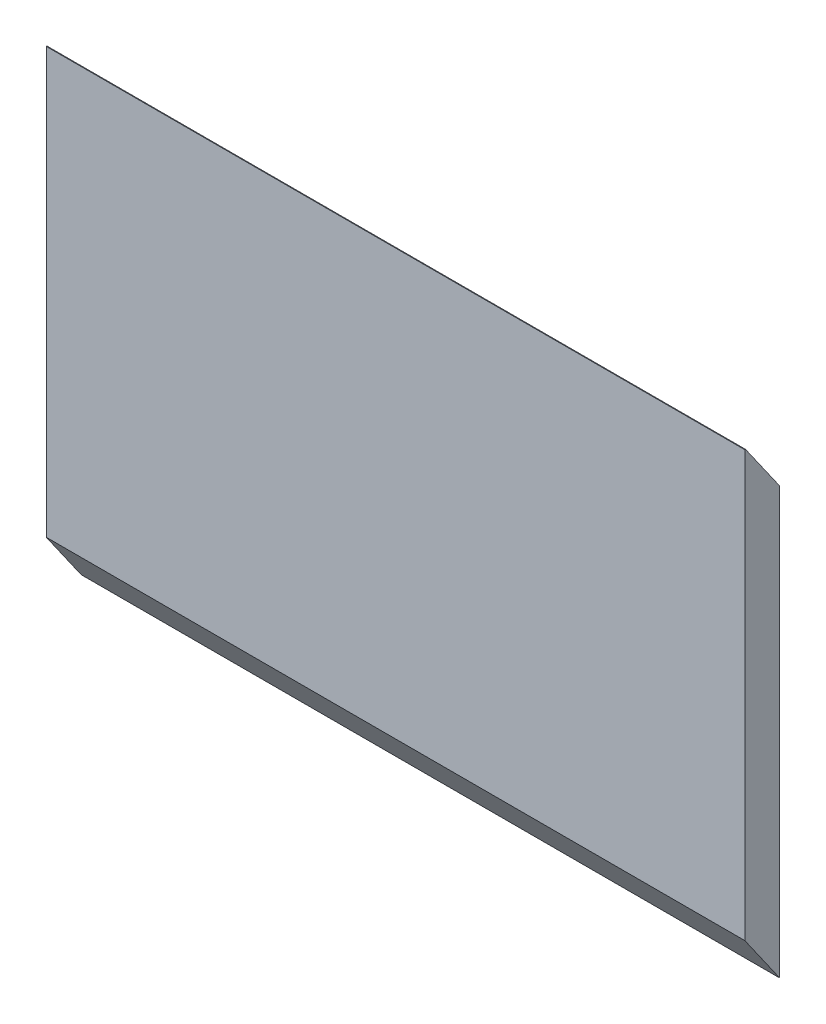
ISO-10303-21;
HEADER;
FILE_DESCRIPTION(('STEP AP214'),'2;1');
FILE_NAME('part.step','',(''),(''),'','','');
FILE_SCHEMA(('AUTOMOTIVE_DESIGN { 1 0 10303 214 1 1 1 1 }'));
ENDSEC;
DATA;
#1=APPLICATION_CONTEXT('core data for automotive mechanical design processes');
#2=APPLICATION_PROTOCOL_DEFINITION('international standard','automotive_design',2000,#1);
#3=PRODUCT_CONTEXT('',#1,'mechanical');
#4=PRODUCT('Part','Part','',(#3));
#5=PRODUCT_RELATED_PRODUCT_CATEGORY('part','',(#4));
#6=PRODUCT_DEFINITION_FORMATION('','',#4);
#7=PRODUCT_DEFINITION_CONTEXT('part definition',#1,'design');
#8=PRODUCT_DEFINITION('design','',#6,#7);
#9=PRODUCT_DEFINITION_SHAPE('','',#8);
#10=(LENGTH_UNIT() NAMED_UNIT(*) SI_UNIT(.MILLI.,.METRE.));
#11=(NAMED_UNIT(*) PLANE_ANGLE_UNIT() SI_UNIT($,.RADIAN.));
#12=(NAMED_UNIT(*) SI_UNIT($,.STERADIAN.) SOLID_ANGLE_UNIT());
#13=UNCERTAINTY_MEASURE_WITH_UNIT(LENGTH_MEASURE(1.E-05),#10,'distance_accuracy_value','');
#14=(GEOMETRIC_REPRESENTATION_CONTEXT(3) GLOBAL_UNCERTAINTY_ASSIGNED_CONTEXT((#13)) GLOBAL_UNIT_ASSIGNED_CONTEXT((#10,
#11,#12)) REPRESENTATION_CONTEXT('',''));
#15=CARTESIAN_POINT('',(0.,0.,0.));
#16=DIRECTION('',(0.,0.,1.));
#17=DIRECTION('',(1.,0.,0.));
#18=AXIS2_PLACEMENT_3D('',#15,#16,#17);
#19=CARTESIAN_POINT('',(-63.5,43.18,3.175));
#20=DIRECTION('',(1.,0.,0.));
#21=DIRECTION('',(0.,0.,-1.));
#22=AXIS2_PLACEMENT_3D('',#19,#20,#21);
#23=PLANE('',#22);
#24=DIRECTION('',(0.,-1.,0.));
#25=VECTOR('',#24,1.);
#26=CARTESIAN_POINT('',(-63.5,43.18,-3.175));
#27=LINE('',#26,#25);
#28=CARTESIAN_POINT('',(-63.5,34.2899999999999,-3.175));
#29=VERTEX_POINT('',#28);
#30=CARTESIAN_POINT('',(-63.5,-43.18,-3.175));
#31=VERTEX_POINT('',#30);
#32=EDGE_CURVE('E111',#29,#31,#27,.T.);
#33=ORIENTED_EDGE('',*,*,#32,.T.);
#34=DIRECTION('',(0.,0.819152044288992,0.573576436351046));
#35=VECTOR('',#34,1.);
#36=CARTESIAN_POINT('',(-63.5,-34.1112601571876,3.175));
#37=LINE('',#36,#35);
#38=CARTESIAN_POINT('',(-63.5,-34.1112601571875,3.17500000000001));
#39=VERTEX_POINT('',#38);
#40=EDGE_CURVE('E11',#31,#39,#37,.T.);
#41=ORIENTED_EDGE('',*,*,#40,.T.);
#42=DIRECTION('',(0.,-1.,0.));
#43=VECTOR('',#42,1.);
#44=CARTESIAN_POINT('',(-63.5,43.18,3.175));
#45=LINE('',#44,#43);
#46=CARTESIAN_POINT('',(-63.5,43.18,3.175));
#47=VERTEX_POINT('',#46);
#48=EDGE_CURVE('E91',#47,#39,#45,.T.);
#49=ORIENTED_EDGE('',*,*,#48,.F.);
#50=DIRECTION('',(0.,0.,-1.));
#51=VECTOR('',#50,1.);
#52=CARTESIAN_POINT('',(-63.5,43.18,3.175));
#53=LINE('',#52,#51);
#54=CARTESIAN_POINT('',(-63.5,43.18,3.04984501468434));
#55=VERTEX_POINT('',#54);
#56=EDGE_CURVE('E103',#47,#55,#53,.T.);
#57=ORIENTED_EDGE('',*,*,#56,.T.);
#58=DIRECTION('',(0.,0.819152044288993,0.573576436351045));
#59=VECTOR('',#58,1.);
#60=CARTESIAN_POINT('',(-63.5,43.18,3.04984501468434));
#61=LINE('',#60,#59);
#62=EDGE_CURVE('E119',#55,#29,#61,.F.);
#63=ORIENTED_EDGE('',*,*,#62,.T.);
#64=EDGE_LOOP('',(#33,#41,#49,#57,#63));
#65=FACE_BOUND('',#64,.T.);
#66=ADVANCED_FACE('F37',(#65),#23,.F.);
#67=CARTESIAN_POINT('',(63.5,43.18,3.175));
#68=DIRECTION('',(-1.,0.,0.));
#69=DIRECTION('',(0.,0.,1.));
#70=AXIS2_PLACEMENT_3D('',#67,#68,#69);
#71=PLANE('',#70);
#72=DIRECTION('',(0.,1.,0.));
#73=VECTOR('',#72,1.);
#74=CARTESIAN_POINT('',(63.5,43.18,3.175));
#75=LINE('',#74,#73);
#76=CARTESIAN_POINT('',(63.5,-34.1112601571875,3.17500000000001));
#77=VERTEX_POINT('',#76);
#78=CARTESIAN_POINT('',(63.5,43.18,3.175));
#79=VERTEX_POINT('',#78);
#80=EDGE_CURVE('E82',#77,#79,#75,.T.);
#81=ORIENTED_EDGE('',*,*,#80,.F.);
#82=DIRECTION('',(0.,-0.819152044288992,-0.573576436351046));
#83=VECTOR('',#82,1.);
#84=CARTESIAN_POINT('',(63.5,-34.1112601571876,3.175));
#85=LINE('',#84,#83);
#86=CARTESIAN_POINT('',(63.5,-43.18,-3.175));
#87=VERTEX_POINT('',#86);
#88=EDGE_CURVE('E45',#77,#87,#85,.T.);
#89=ORIENTED_EDGE('',*,*,#88,.T.);
#90=DIRECTION('',(0.,1.,0.));
#91=VECTOR('',#90,1.);
#92=CARTESIAN_POINT('',(63.5,43.18,-3.175));
#93=LINE('',#92,#91);
#94=CARTESIAN_POINT('',(63.5,34.2899999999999,-3.175));
#95=VERTEX_POINT('',#94);
#96=EDGE_CURVE('E116',#87,#95,#93,.T.);
#97=ORIENTED_EDGE('',*,*,#96,.T.);
#98=DIRECTION('',(0.,-0.819152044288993,-0.573576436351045));
#99=VECTOR('',#98,1.);
#100=CARTESIAN_POINT('',(63.5,43.18,3.04984501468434));
#101=LINE('',#100,#99);
#102=CARTESIAN_POINT('',(63.5,43.18,3.04984501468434));
#103=VERTEX_POINT('',#102);
#104=EDGE_CURVE('E98',#95,#103,#101,.F.);
#105=ORIENTED_EDGE('',*,*,#104,.T.);
#106=DIRECTION('',(0.,0.,-1.));
#107=VECTOR('',#106,1.);
#108=CARTESIAN_POINT('',(63.5,43.18,3.175));
#109=LINE('',#108,#107);
#110=EDGE_CURVE('E94',#79,#103,#109,.T.);
#111=ORIENTED_EDGE('',*,*,#110,.F.);
#112=EDGE_LOOP('',(#81,#89,#97,#105,#111));
#113=FACE_BOUND('',#112,.T.);
#114=ADVANCED_FACE('F95',(#113),#71,.F.);
#115=CARTESIAN_POINT('',(-63.5,43.18,3.175));
#116=DIRECTION('',(0.,-1.,0.));
#117=DIRECTION('',(0.,0.,-1.));
#118=AXIS2_PLACEMENT_3D('',#115,#116,#117);
#119=PLANE('',#118);
#120=ORIENTED_EDGE('',*,*,#110,.T.);
#121=DIRECTION('',(-1.,0.,0.));
#122=VECTOR('',#121,1.);
#123=CARTESIAN_POINT('',(-63.5,43.18,3.04984501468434));
#124=LINE('',#123,#122);
#125=EDGE_CURVE('E102',#103,#55,#124,.T.);
#126=ORIENTED_EDGE('',*,*,#125,.T.);
#127=ORIENTED_EDGE('',*,*,#56,.F.);
#128=DIRECTION('',(-1.,0.,0.));
#129=VECTOR('',#128,1.);
#130=CARTESIAN_POINT('',(-63.5,43.18,3.175));
#131=LINE('',#130,#129);
#132=EDGE_CURVE('E86',#79,#47,#131,.T.);
#133=ORIENTED_EDGE('',*,*,#132,.F.);
#134=EDGE_LOOP('',(#120,#126,#127,#133));
#135=FACE_BOUND('',#134,.T.);
#136=ADVANCED_FACE('F105',(#135),#119,.F.);
#137=CARTESIAN_POINT('',(0.,0.,3.175));
#138=DIRECTION('',(0.,0.,1.));
#139=DIRECTION('',(1.,0.,0.));
#140=AXIS2_PLACEMENT_3D('',#137,#138,#139);
#141=PLANE('',#140);
#142=ORIENTED_EDGE('',*,*,#48,.T.);
#143=DIRECTION('',(1.,0.,0.));
#144=VECTOR('',#143,1.);
#145=CARTESIAN_POINT('',(63.5,-34.1112601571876,3.175));
#146=LINE('',#145,#144);
#147=EDGE_CURVE('E88',#39,#77,#146,.T.);
#148=ORIENTED_EDGE('',*,*,#147,.T.);
#149=ORIENTED_EDGE('',*,*,#80,.T.);
#150=ORIENTED_EDGE('',*,*,#132,.T.);
#151=EDGE_LOOP('',(#142,#148,#149,#150));
#152=FACE_BOUND('',#151,.T.);
#153=ADVANCED_FACE('F84',(#152),#141,.T.);
#154=CARTESIAN_POINT('',(0.,0.,-3.175));
#155=DIRECTION('',(0.,0.,1.));
#156=DIRECTION('',(1.,0.,0.));
#157=AXIS2_PLACEMENT_3D('',#154,#155,#156);
#158=PLANE('',#157);
#159=ORIENTED_EDGE('',*,*,#32,.F.);
#160=DIRECTION('',(1.,0.,0.));
#161=VECTOR('',#160,1.);
#162=CARTESIAN_POINT('',(0.,34.2899999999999,-3.175));
#163=LINE('',#162,#161);
#164=EDGE_CURVE('E121',#29,#95,#163,.T.);
#165=ORIENTED_EDGE('',*,*,#164,.T.);
#166=ORIENTED_EDGE('',*,*,#96,.F.);
#167=DIRECTION('',(1.,0.,0.));
#168=VECTOR('',#167,1.);
#169=CARTESIAN_POINT('',(-63.5,-43.18,-3.175));
#170=LINE('',#169,#168);
#171=EDGE_CURVE('E114',#31,#87,#170,.T.);
#172=ORIENTED_EDGE('',*,*,#171,.F.);
#173=EDGE_LOOP('',(#159,#165,#166,#172));
#174=FACE_BOUND('',#173,.T.);
#175=ADVANCED_FACE('F129',(#174),#158,.F.);
#176=CARTESIAN_POINT('',(-63.5,43.18,3.04984501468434));
#177=DIRECTION('',(0.,-0.573576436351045,0.819152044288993));
#178=DIRECTION('',(-1.,0.,0.));
#179=AXIS2_PLACEMENT_3D('',#176,#177,#178);
#180=PLANE('',#179);
#181=ORIENTED_EDGE('',*,*,#104,.F.);
#182=ORIENTED_EDGE('',*,*,#164,.F.);
#183=ORIENTED_EDGE('',*,*,#62,.F.);
#184=ORIENTED_EDGE('',*,*,#125,.F.);
#185=EDGE_LOOP('',(#181,#182,#183,#184));
#186=FACE_BOUND('',#185,.T.);
#187=ADVANCED_FACE('F132',(#186),#180,.F.);
#188=CARTESIAN_POINT('',(0.,-34.1112601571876,3.175));
#189=DIRECTION('',(0.,-0.573576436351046,0.819152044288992));
#190=DIRECTION('',(-1.,0.,0.));
#191=AXIS2_PLACEMENT_3D('',#188,#189,#190);
#192=PLANE('',#191);
#193=ORIENTED_EDGE('',*,*,#40,.F.);
#194=ORIENTED_EDGE('',*,*,#171,.T.);
#195=ORIENTED_EDGE('',*,*,#88,.F.);
#196=ORIENTED_EDGE('',*,*,#147,.F.);
#197=EDGE_LOOP('',(#193,#194,#195,#196));
#198=FACE_BOUND('',#197,.T.);
#199=ADVANCED_FACE('F39',(#198),#192,.T.);
#200=CLOSED_SHELL('',(#66,#114,#136,#153,#175,#187,#199));
#201=MANIFOLD_SOLID_BREP('B2',#200);
#202=ADVANCED_BREP_SHAPE_REPRESENTATION('',(#18,#201),#14);
#203=SHAPE_DEFINITION_REPRESENTATION(#9,#202);
ENDSEC;
END-ISO-10303-21;
